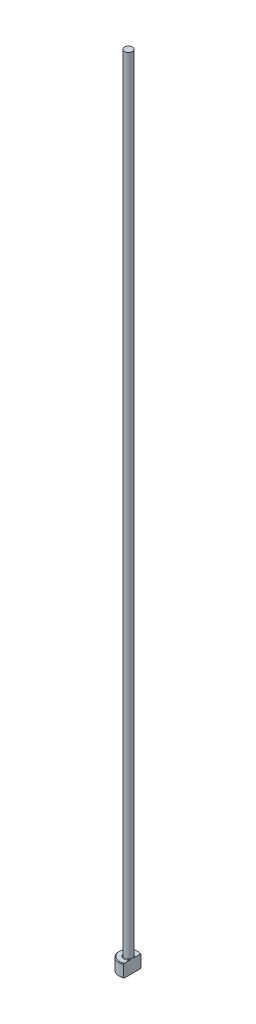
ISO-10303-21;
HEADER;
FILE_DESCRIPTION(('STEP AP214'),'2;1');
FILE_NAME('part.step','',(''),(''),'','','');
FILE_SCHEMA(('AUTOMOTIVE_DESIGN { 1 0 10303 214 1 1 1 1 }'));
ENDSEC;
DATA;
#1=APPLICATION_CONTEXT('core data for automotive mechanical design processes');
#2=APPLICATION_PROTOCOL_DEFINITION('international standard','automotive_design',2000,#1);
#3=PRODUCT_CONTEXT('',#1,'mechanical');
#4=PRODUCT('Part','Part','',(#3));
#5=PRODUCT_RELATED_PRODUCT_CATEGORY('part','',(#4));
#6=PRODUCT_DEFINITION_FORMATION('','',#4);
#7=PRODUCT_DEFINITION_CONTEXT('part definition',#1,'design');
#8=PRODUCT_DEFINITION('design','',#6,#7);
#9=PRODUCT_DEFINITION_SHAPE('','',#8);
#10=(LENGTH_UNIT() NAMED_UNIT(*) SI_UNIT(.MILLI.,.METRE.));
#11=(NAMED_UNIT(*) PLANE_ANGLE_UNIT() SI_UNIT($,.RADIAN.));
#12=(NAMED_UNIT(*) SI_UNIT($,.STERADIAN.) SOLID_ANGLE_UNIT());
#13=UNCERTAINTY_MEASURE_WITH_UNIT(LENGTH_MEASURE(1.E-05),#10,'distance_accuracy_value','');
#14=(GEOMETRIC_REPRESENTATION_CONTEXT(3) GLOBAL_UNCERTAINTY_ASSIGNED_CONTEXT((#13)) GLOBAL_UNIT_ASSIGNED_CONTEXT((#10,
#11,#12)) REPRESENTATION_CONTEXT('',''));
#15=CARTESIAN_POINT('',(0.,0.,0.));
#16=DIRECTION('',(0.,0.,1.));
#17=DIRECTION('',(1.,0.,0.));
#18=AXIS2_PLACEMENT_3D('',#15,#16,#17);
#19=CARTESIAN_POINT('',(0.,0.,0.));
#20=DIRECTION('',(0.,-1.,0.));
#21=DIRECTION('',(0.,0.,-1.));
#22=AXIS2_PLACEMENT_3D('',#19,#20,#21);
#23=PLANE('',#22);
#24=CARTESIAN_POINT('',(0.,0.,0.));
#25=DIRECTION('',(0.,-1.,0.));
#26=DIRECTION('',(0.,0.,-1.));
#27=AXIS2_PLACEMENT_3D('',#24,#25,#26);
#28=CIRCLE('',#27,2.8);
#29=CARTESIAN_POINT('',(1.24999999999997,0.,2.50549396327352));
#30=VERTEX_POINT('',#29);
#31=CARTESIAN_POINT('',(1.24999999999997,0.,-2.50549396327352));
#32=VERTEX_POINT('',#31);
#33=EDGE_CURVE('E98',#30,#32,#28,.T.);
#34=ORIENTED_EDGE('',*,*,#33,.T.);
#35=DIRECTION('',(0.,0.,1.));
#36=VECTOR('',#35,1.);
#37=CARTESIAN_POINT('',(1.24999999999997,0.,2.72717802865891));
#38=LINE('',#37,#36);
#39=EDGE_CURVE('E83',#32,#30,#38,.T.);
#40=ORIENTED_EDGE('',*,*,#39,.T.);
#41=EDGE_LOOP('',(#34,#40));
#42=FACE_BOUND('',#41,.T.);
#43=ADVANCED_FACE('F32',(#42),#23,.T.);
#44=CARTESIAN_POINT('',(0.,259.958771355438,0.));
#45=DIRECTION('',(0.,1.,0.));
#46=DIRECTION('',(0.,0.,1.));
#47=AXIS2_PLACEMENT_3D('',#44,#45,#46);
#48=CYLINDRICAL_SURFACE('',#47,2.99999999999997);
#49=CARTESIAN_POINT('',(0.,3.80000000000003,0.));
#50=DIRECTION('',(0.,1.,0.));
#51=DIRECTION('',(0.,0.,1.));
#52=AXIS2_PLACEMENT_3D('',#49,#50,#51);
#53=CIRCLE('',#52,2.99999999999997);
#54=CARTESIAN_POINT('',(1.24999999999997,3.80000000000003,2.72717802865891));
#55=VERTEX_POINT('',#54);
#56=CARTESIAN_POINT('',(1.24999999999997,3.80000000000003,-2.72717802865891));
#57=VERTEX_POINT('',#56);
#58=EDGE_CURVE('E104',#55,#57,#53,.F.);
#59=ORIENTED_EDGE('',*,*,#58,.T.);
#60=DIRECTION('',(0.,-1.,0.));
#61=VECTOR('',#60,1.);
#62=CARTESIAN_POINT('',(1.24999999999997,250.,-2.72717802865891));
#63=LINE('',#62,#61);
#64=CARTESIAN_POINT('',(1.24999999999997,0.199999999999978,-2.72717802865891));
#65=VERTEX_POINT('',#64);
#66=EDGE_CURVE('E183',#57,#65,#63,.T.);
#67=ORIENTED_EDGE('',*,*,#66,.T.);
#68=CARTESIAN_POINT('',(0.,0.199999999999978,0.));
#69=DIRECTION('',(0.,-1.,0.));
#70=DIRECTION('',(0.,0.,-1.));
#71=AXIS2_PLACEMENT_3D('',#68,#69,#70);
#72=CIRCLE('',#71,2.99999999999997);
#73=CARTESIAN_POINT('',(1.24999999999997,0.199999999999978,2.72717802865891));
#74=VERTEX_POINT('',#73);
#75=EDGE_CURVE('E100',#65,#74,#72,.F.);
#76=ORIENTED_EDGE('',*,*,#75,.T.);
#77=DIRECTION('',(0.,-1.,0.));
#78=VECTOR('',#77,1.);
#79=CARTESIAN_POINT('',(1.24999999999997,250.,2.72717802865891));
#80=LINE('',#79,#78);
#81=EDGE_CURVE('E93',#55,#74,#80,.T.);
#82=ORIENTED_EDGE('',*,*,#81,.F.);
#83=EDGE_LOOP('',(#59,#67,#76,#82));
#84=FACE_BOUND('',#83,.T.);
#85=ADVANCED_FACE('F158',(#84),#48,.T.);
#86=CARTESIAN_POINT('',(-2.99999999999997,4.,0.));
#87=DIRECTION('',(0.,1.,0.));
#88=DIRECTION('',(0.,0.,1.));
#89=AXIS2_PLACEMENT_3D('',#86,#87,#88);
#90=PLANE('',#89);
#91=CARTESIAN_POINT('',(0.,4.,0.));
#92=DIRECTION('',(0.,1.,0.));
#93=DIRECTION('',(0.,0.,1.));
#94=AXIS2_PLACEMENT_3D('',#91,#92,#93);
#95=CIRCLE('',#94,2.80000000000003);
#96=CARTESIAN_POINT('',(1.24999999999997,4.,-2.50549396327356));
#97=VERTEX_POINT('',#96);
#98=CARTESIAN_POINT('',(1.24999999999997,4.,2.50549396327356));
#99=VERTEX_POINT('',#98);
#100=EDGE_CURVE('E178',#97,#99,#95,.T.);
#101=ORIENTED_EDGE('',*,*,#100,.T.);
#102=DIRECTION('',(0.,0.,-1.));
#103=VECTOR('',#102,1.);
#104=CARTESIAN_POINT('',(1.24999999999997,4.,0.));
#105=LINE('',#104,#103);
#106=CARTESIAN_POINT('',(1.24999999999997,3.99999999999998,0.734846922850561));
#107=VERTEX_POINT('',#106);
#108=EDGE_CURVE('E57',#99,#107,#105,.T.);
#109=ORIENTED_EDGE('',*,*,#108,.T.);
#110=CARTESIAN_POINT('',(0.,4.,0.));
#111=DIRECTION('',(0.,1.,0.));
#112=DIRECTION('',(0.,0.,1.));
#113=AXIS2_PLACEMENT_3D('',#110,#111,#112);
#114=CIRCLE('',#113,1.44999999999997);
#115=CARTESIAN_POINT('',(1.24999999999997,3.99999999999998,-0.734846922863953));
#116=VERTEX_POINT('',#115);
#117=EDGE_CURVE('E107',#107,#116,#114,.F.);
#118=ORIENTED_EDGE('',*,*,#117,.T.);
#119=EDGE_CURVE('E136',#116,#97,#105,.T.);
#120=ORIENTED_EDGE('',*,*,#119,.T.);
#121=EDGE_LOOP('',(#101,#109,#118,#120));
#122=FACE_BOUND('',#121,.T.);
#123=ADVANCED_FACE('F147',(#122),#90,.T.);
#124=CARTESIAN_POINT('',(0.,4.,0.));
#125=DIRECTION('',(0.,-1.,0.));
#126=DIRECTION('',(0.,0.,-1.));
#127=AXIS2_PLACEMENT_3D('',#124,#125,#126);
#128=CONICAL_SURFACE('',#127,2.80000000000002,0.785398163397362);
#129=ORIENTED_EDGE('',*,*,#58,.F.);
#130=CARTESIAN_POINT('',(1.24999999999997,0.669029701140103,6.00219100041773));
#131=CARTESIAN_POINT('',(1.24999999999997,0.81160818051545,5.85654654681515));
#132=CARTESIAN_POINT('',(1.24999999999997,0.954083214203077,5.71080056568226));
#133=CARTESIAN_POINT('',(1.24999999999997,1.23900024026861,5.41878816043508));
#134=CARTESIAN_POINT('',(1.24999999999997,1.38144175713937,5.27252127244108));
#135=CARTESIAN_POINT('',(1.24999999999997,1.67009506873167,4.97540906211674));
#136=CARTESIAN_POINT('',(1.24999999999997,1.81629662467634,4.82455378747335));
#137=CARTESIAN_POINT('',(1.24999999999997,2.1079628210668,4.52263591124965));
#138=CARTESIAN_POINT('',(1.24999999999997,2.2534282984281,4.37157411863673));
#139=CARTESIAN_POINT('',(1.24999999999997,2.53664042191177,4.07620034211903));
#140=CARTESIAN_POINT('',(1.24999999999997,2.67441792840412,3.9319179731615));
#141=CARTESIAN_POINT('',(1.24999999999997,2.94919792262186,3.64255917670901));
#142=CARTESIAN_POINT('',(1.24999999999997,3.08620024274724,3.49748258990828));
#143=CARTESIAN_POINT('',(1.24999999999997,3.36003302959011,3.20523168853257));
#144=CARTESIAN_POINT('',(1.24999999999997,3.49685542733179,3.05804979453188));
#145=CARTESIAN_POINT('',(1.24999999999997,3.76866895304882,2.762223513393));
#146=CARTESIAN_POINT('',(1.24999999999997,3.90366148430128,2.61358041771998));
#147=CARTESIAN_POINT('',(1.24999999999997,4.16725075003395,2.3180330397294));
#148=CARTESIAN_POINT('',(1.24999999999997,4.2959210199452,2.17119494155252));
#149=CARTESIAN_POINT('',(1.24999999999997,4.48585031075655,1.94789558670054));
#150=CARTESIAN_POINT('',(1.24999999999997,4.54874737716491,1.87283059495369));
#151=CARTESIAN_POINT('',(1.24999999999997,4.67301560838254,1.72146479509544));
#152=CARTESIAN_POINT('',(1.24999999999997,4.73438704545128,1.64516421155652));
#153=CARTESIAN_POINT('',(1.24999999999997,4.85417557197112,1.49197305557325));
#154=CARTESIAN_POINT('',(1.24999999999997,4.91262187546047,1.41510543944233));
#155=CARTESIAN_POINT('',(1.24999999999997,5.02658525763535,1.259105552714));
#156=CARTESIAN_POINT('',(1.24999999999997,5.08209990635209,1.17997148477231));
#157=CARTESIAN_POINT('',(1.24999999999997,5.18831713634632,1.01914711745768));
#158=CARTESIAN_POINT('',(1.24999999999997,5.23904487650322,0.937473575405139));
#159=CARTESIAN_POINT('',(1.24999999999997,5.33341065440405,0.770163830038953));
#160=CARTESIAN_POINT('',(1.24999999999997,5.37706287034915,0.684536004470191));
#161=CARTESIAN_POINT('',(1.24999999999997,5.42311846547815,0.577571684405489));
#162=CARTESIAN_POINT('',(1.24999999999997,5.43098597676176,0.558575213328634));
#163=CARTESIAN_POINT('',(1.24999999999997,5.44613719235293,0.520340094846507));
#164=CARTESIAN_POINT('',(1.24999999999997,5.45342063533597,0.501101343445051));
#165=CARTESIAN_POINT('',(1.24999999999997,5.46734064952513,0.46239234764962));
#166=CARTESIAN_POINT('',(1.24999999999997,5.47397728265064,0.442922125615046));
#167=CARTESIAN_POINT('',(1.24999999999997,5.48654090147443,0.403756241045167));
#168=CARTESIAN_POINT('',(1.24999999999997,5.49246793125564,0.384060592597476));
#169=CARTESIAN_POINT('',(1.24999999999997,5.50889838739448,0.325328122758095));
#170=CARTESIAN_POINT('',(1.24999999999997,5.51829705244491,0.285972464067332));
#171=CARTESIAN_POINT('',(1.24999999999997,5.53364447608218,0.206573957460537));
#172=CARTESIAN_POINT('',(1.24999999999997,5.53959211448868,0.166530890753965));
#173=CARTESIAN_POINT('',(1.24999999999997,5.54775364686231,0.0853257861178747));
#174=CARTESIAN_POINT('',(1.24999999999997,5.54989812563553,0.0441566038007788));
#175=CARTESIAN_POINT('',(1.24999999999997,5.55009472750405,-0.038178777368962));
#176=CARTESIAN_POINT('',(1.24999999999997,5.54814807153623,-0.0793449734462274));
#177=CARTESIAN_POINT('',(1.24999999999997,5.540286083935,-0.161410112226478));
#178=CARTESIAN_POINT('',(1.24999999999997,5.53435930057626,-0.202307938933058));
#179=CARTESIAN_POINT('',(1.24999999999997,5.51889139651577,-0.283420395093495));
#180=CARTESIAN_POINT('',(1.24999999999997,5.50934853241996,-0.323634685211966));
#181=CARTESIAN_POINT('',(1.24999999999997,5.48253027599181,-0.41970113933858));
#182=CARTESIAN_POINT('',(1.24999999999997,5.4636894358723,-0.475114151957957));
#183=CARTESIAN_POINT('',(1.24999999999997,5.42119888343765,-0.584051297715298));
#184=CARTESIAN_POINT('',(1.24999999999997,5.39754618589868,-0.637574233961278));
#185=CARTESIAN_POINT('',(1.24999999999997,5.34650154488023,-0.743173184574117));
#186=CARTESIAN_POINT('',(1.24999999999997,5.31908834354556,-0.795238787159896));
#187=CARTESIAN_POINT('',(1.24999999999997,5.26156746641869,-0.897817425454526));
#188=CARTESIAN_POINT('',(1.24999999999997,5.23146075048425,-0.948331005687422));
#189=CARTESIAN_POINT('',(1.24999999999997,5.164212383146,-1.05610178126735));
#190=CARTESIAN_POINT('',(1.24999999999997,5.12671791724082,-1.11313743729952));
#191=CARTESIAN_POINT('',(1.24999999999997,5.04971534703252,-1.22583866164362));
#192=CARTESIAN_POINT('',(1.24999999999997,5.01020681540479,-1.28150393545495));
#193=CARTESIAN_POINT('',(1.24999999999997,4.88938978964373,-1.4469495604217));
#194=CARTESIAN_POINT('',(1.24999999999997,4.80584655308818,-1.55509257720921));
#195=CARTESIAN_POINT('',(1.24999999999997,4.63502000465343,-1.76881938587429));
#196=CARTESIAN_POINT('',(1.24999999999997,4.54772710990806,-1.87439538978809));
#197=CARTESIAN_POINT('',(1.24999999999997,4.37088701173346,-2.08355531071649));
#198=CARTESIAN_POINT('',(1.24999999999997,4.28134083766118,-2.18714010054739));
#199=CARTESIAN_POINT('',(1.24999999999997,4.10042772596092,-2.39324626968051));
#200=CARTESIAN_POINT('',(1.24999999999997,4.00905617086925,-2.49576357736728));
#201=CARTESIAN_POINT('',(1.24999999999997,3.82518962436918,-2.69980391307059));
#202=CARTESIAN_POINT('',(1.24999999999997,3.73269451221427,-2.80132683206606));
#203=CARTESIAN_POINT('',(1.24999999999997,3.45429710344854,-3.10446128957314));
#204=CARTESIAN_POINT('',(1.24999999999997,3.26719139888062,-3.30496607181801));
#205=CARTESIAN_POINT('',(1.24999999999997,2.87989899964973,-3.71613563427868));
#206=CARTESIAN_POINT('',(1.24999999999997,2.67959819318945,-3.92669240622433));
#207=CARTESIAN_POINT('',(1.24999999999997,2.27757992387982,-4.34666060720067));
#208=CARTESIAN_POINT('',(1.24999999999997,2.07586177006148,-4.55607137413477));
#209=CARTESIAN_POINT('',(1.24999999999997,1.67356669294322,-4.97197982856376));
#210=CARTESIAN_POINT('',(1.24999999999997,1.47299831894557,-5.17848579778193));
#211=CARTESIAN_POINT('',(1.24999999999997,1.07135927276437,-5.59078665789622));
#212=CARTESIAN_POINT('',(1.24999999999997,0.870288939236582,-5.79658187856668));
#213=CARTESIAN_POINT('',(1.24999999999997,0.669029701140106,-6.00219100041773));
#214=B_SPLINE_CURVE_WITH_KNOTS('',3,(#130,#131,#132,#133,#134,#135,#136,#137,#138,#139,#140,
#141,#142,#143,#144,#145,#146,#147,#148,#149,#150,#151,#152,#153,#154,#155,#156,#157,#158,#159,
#160,#161,#162,#163,#164,#165,#166,#167,#168,#169,#170,#171,#172,#173,#174,#175,#176,#177,#178,
#179,#180,#181,#182,#183,#184,#185,#186,#187,#188,#189,#190,#191,#192,#193,#194,#195,#196,#197,
#198,#199,#200,#201,#202,#203,#204,#205,#206,#207,#208,#209,#210,#211,#212,#213),.UNSPECIFIED.,
.F.,.F.,(4,2,2,2,2,2,2,2,2,2,2,2,2,2,2,2,2,2,2,2,2,2,2,2,2,2,2,2,2,2,2,2,2,2,2,2,2,2,2,2,2,4),
(0.,0.611447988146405,1.22394436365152,1.85417356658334,2.48331351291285,3.08180969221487,
3.68043067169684,4.28328558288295,4.88564854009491,5.47129854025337,5.7650827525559,
6.05881415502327,6.34846123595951,6.63834474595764,6.92660821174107,7.21428670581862,
7.27596254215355,7.33766582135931,7.39936318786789,7.46105671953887,7.58229876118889,
7.70358013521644,7.82705319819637,7.95048941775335,8.0742823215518,8.19813498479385,
8.37340718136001,8.54878844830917,8.72520546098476,8.90155985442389,9.10626834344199,
9.31102044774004,9.72083602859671,10.131769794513,10.5425191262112,10.9544882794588,
11.3665021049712,12.1892148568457,13.0610401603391,13.9333249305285,14.7969505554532,
15.6600991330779),.UNSPECIFIED.);
#215=EDGE_CURVE('E135',#55,#99,#214,.T.);
#216=ORIENTED_EDGE('',*,*,#215,.T.);
#217=ORIENTED_EDGE('',*,*,#100,.F.);
#218=EDGE_CURVE('E127',#97,#57,#214,.T.);
#219=ORIENTED_EDGE('',*,*,#218,.T.);
#220=EDGE_LOOP('',(#129,#216,#217,#219));
#221=FACE_BOUND('',#220,.T.);
#222=ADVANCED_FACE('F143',(#221),#128,.T.);
#223=CARTESIAN_POINT('',(0.,0.199999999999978,0.));
#224=DIRECTION('',(0.,1.,0.));
#225=DIRECTION('',(0.,0.,1.));
#226=AXIS2_PLACEMENT_3D('',#223,#224,#225);
#227=CONICAL_SURFACE('',#226,2.99999999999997,0.785398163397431);
#228=ORIENTED_EDGE('',*,*,#75,.F.);
#229=CARTESIAN_POINT('',(1.24999999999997,3.33097029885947,-6.00219100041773));
#230=CARTESIAN_POINT('',(1.24999999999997,3.18839181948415,-5.85654654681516));
#231=CARTESIAN_POINT('',(1.24999999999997,3.04591678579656,-5.71080056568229));
#232=CARTESIAN_POINT('',(1.24999999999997,2.76099975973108,-5.41878816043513));
#233=CARTESIAN_POINT('',(1.24999999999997,2.61855824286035,-5.27252127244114));
#234=CARTESIAN_POINT('',(1.24999999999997,2.32990493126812,-4.97540906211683));
#235=CARTESIAN_POINT('',(1.24999999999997,2.18370337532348,-4.82455378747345));
#236=CARTESIAN_POINT('',(1.24999999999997,1.89203717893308,-4.52263591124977));
#237=CARTESIAN_POINT('',(1.24999999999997,1.74657170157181,-4.37157411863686));
#238=CARTESIAN_POINT('',(1.24999999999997,1.46335957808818,-4.07620034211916));
#239=CARTESIAN_POINT('',(1.24999999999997,1.32558207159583,-3.93191797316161));
#240=CARTESIAN_POINT('',(1.24999999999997,1.0508020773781,-3.64255917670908));
#241=CARTESIAN_POINT('',(1.24999999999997,0.913799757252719,-3.49748258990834));
#242=CARTESIAN_POINT('',(1.24999999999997,0.639966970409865,-3.2052316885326));
#243=CARTESIAN_POINT('',(1.24999999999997,0.503144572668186,-3.0580497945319));
#244=CARTESIAN_POINT('',(1.24999999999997,0.231331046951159,-2.76222351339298));
#245=CARTESIAN_POINT('',(1.24999999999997,0.096338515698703,-2.61358041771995));
#246=CARTESIAN_POINT('',(1.24999999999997,-0.16725075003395,-2.31803303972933));
#247=CARTESIAN_POINT('',(1.24999999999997,-0.2959210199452,-2.17119494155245));
#248=CARTESIAN_POINT('',(1.24999999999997,-0.485850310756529,-1.94789558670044));
#249=CARTESIAN_POINT('',(1.24999999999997,-0.548747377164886,-1.87283059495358));
#250=CARTESIAN_POINT('',(1.24999999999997,-0.673015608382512,-1.72146479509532));
#251=CARTESIAN_POINT('',(1.24999999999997,-0.73438704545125,-1.64516421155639));
#252=CARTESIAN_POINT('',(1.24999999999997,-0.854175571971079,-1.49197305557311));
#253=CARTESIAN_POINT('',(1.24999999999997,-0.912621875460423,-1.41510543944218));
#254=CARTESIAN_POINT('',(1.24999999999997,-1.02658525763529,-1.25910555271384));
#255=CARTESIAN_POINT('',(1.24999999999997,-1.08209990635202,-1.17997148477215));
#256=CARTESIAN_POINT('',(1.24999999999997,-1.18831713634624,-1.0191471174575));
#257=CARTESIAN_POINT('',(1.24999999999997,-1.23904487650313,-0.937473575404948));
#258=CARTESIAN_POINT('',(1.24999999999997,-1.33341065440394,-0.770163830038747));
#259=CARTESIAN_POINT('',(1.24999999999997,-1.37706287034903,-0.684536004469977));
#260=CARTESIAN_POINT('',(1.24999999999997,-1.42311846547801,-0.577571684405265));
#261=CARTESIAN_POINT('',(1.24999999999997,-1.43098597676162,-0.558575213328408));
#262=CARTESIAN_POINT('',(1.24999999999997,-1.44613719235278,-0.520340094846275));
#263=CARTESIAN_POINT('',(1.24999999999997,-1.45342063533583,-0.501101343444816));
#264=CARTESIAN_POINT('',(1.24999999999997,-1.46734064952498,-0.46239234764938));
#265=CARTESIAN_POINT('',(1.24999999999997,-1.47397728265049,-0.442922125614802));
#266=CARTESIAN_POINT('',(1.24999999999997,-1.48654090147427,-0.403756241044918));
#267=CARTESIAN_POINT('',(1.24999999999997,-1.49246793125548,-0.384060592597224));
#268=CARTESIAN_POINT('',(1.24999999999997,-1.50889838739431,-0.325328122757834));
#269=CARTESIAN_POINT('',(1.24999999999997,-1.51829705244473,-0.285972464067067));
#270=CARTESIAN_POINT('',(1.24999999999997,-1.53364447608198,-0.206573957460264));
#271=CARTESIAN_POINT('',(1.24999999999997,-1.53959211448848,-0.166530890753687));
#272=CARTESIAN_POINT('',(1.24999999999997,-1.54775364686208,-0.0853257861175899));
#273=CARTESIAN_POINT('',(1.24999999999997,-1.54989812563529,-0.044156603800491));
#274=CARTESIAN_POINT('',(1.24999999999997,-1.55009472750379,0.0381787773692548));
#275=CARTESIAN_POINT('',(1.24999999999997,-1.54814807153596,0.0793449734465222));
#276=CARTESIAN_POINT('',(1.24999999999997,-1.54028608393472,0.161410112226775));
#277=CARTESIAN_POINT('',(1.24999999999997,-1.53435930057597,0.202307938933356));
#278=CARTESIAN_POINT('',(1.24999999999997,-1.51889139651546,0.283420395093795));
#279=CARTESIAN_POINT('',(1.24999999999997,-1.50934853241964,0.323634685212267));
#280=CARTESIAN_POINT('',(1.24999999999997,-1.48253027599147,0.419701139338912));
#281=CARTESIAN_POINT('',(1.24999999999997,-1.46368943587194,0.475114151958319));
#282=CARTESIAN_POINT('',(1.24999999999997,-1.42119888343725,0.584051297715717));
#283=CARTESIAN_POINT('',(1.24999999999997,-1.39754618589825,0.637574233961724));
#284=CARTESIAN_POINT('',(1.24999999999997,-1.34650154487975,0.743173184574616));
#285=CARTESIAN_POINT('',(1.24999999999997,-1.31908834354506,0.795238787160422));
#286=CARTESIAN_POINT('',(1.24999999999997,-1.26156746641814,0.897817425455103));
#287=CARTESIAN_POINT('',(1.24999999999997,-1.23146075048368,0.948331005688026));
#288=CARTESIAN_POINT('',(1.24999999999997,-1.16421238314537,1.05610178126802));
#289=CARTESIAN_POINT('',(1.24999999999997,-1.12671791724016,1.11313743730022));
#290=CARTESIAN_POINT('',(1.24999999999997,-1.0497153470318,1.22583866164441));
#291=CARTESIAN_POINT('',(1.24999999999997,-1.01020681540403,1.28150393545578));
#292=CARTESIAN_POINT('',(1.24999999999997,-0.889389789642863,1.44694956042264));
#293=CARTESIAN_POINT('',(1.24999999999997,-0.805846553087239,1.55509257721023));
#294=CARTESIAN_POINT('',(1.24999999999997,-0.635020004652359,1.76881938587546));
#295=CARTESIAN_POINT('',(1.24999999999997,-0.547727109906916,1.87439538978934));
#296=CARTESIAN_POINT('',(1.24999999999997,-0.370887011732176,2.08355531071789));
#297=CARTESIAN_POINT('',(1.24999999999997,-0.281340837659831,2.18714010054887));
#298=CARTESIAN_POINT('',(1.24999999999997,-0.100427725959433,2.39324626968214));
#299=CARTESIAN_POINT('',(1.24999999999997,-0.00905617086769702,2.49576357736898));
#300=CARTESIAN_POINT('',(1.24999999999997,0.174810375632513,2.69980391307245));
#301=CARTESIAN_POINT('',(1.24999999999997,0.267305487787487,2.80132683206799));
#302=CARTESIAN_POINT('',(1.24999999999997,0.545702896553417,3.1044612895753));
#303=CARTESIAN_POINT('',(1.24999999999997,0.73280860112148,3.30496607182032));
#304=CARTESIAN_POINT('',(1.24999999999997,1.12010100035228,3.71613563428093));
#305=CARTESIAN_POINT('',(1.24999999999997,1.32040180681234,3.92669240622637));
#306=CARTESIAN_POINT('',(1.24999999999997,1.72242007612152,4.34666060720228));
#307=CARTESIAN_POINT('',(1.24999999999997,1.92413822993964,4.55607137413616));
#308=CARTESIAN_POINT('',(1.24999999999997,2.32643330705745,4.97197982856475));
#309=CARTESIAN_POINT('',(1.24999999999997,2.52700168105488,5.17848579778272));
#310=CARTESIAN_POINT('',(1.24999999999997,2.92864072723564,5.59078665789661));
#311=CARTESIAN_POINT('',(1.24999999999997,3.12971106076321,5.79658187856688));
#312=CARTESIAN_POINT('',(1.24999999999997,3.33097029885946,6.00219100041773));
#313=B_SPLINE_CURVE_WITH_KNOTS('',3,(#229,#230,#231,#232,#233,#234,#235,#236,#237,#238,#239,
#240,#241,#242,#243,#244,#245,#246,#247,#248,#249,#250,#251,#252,#253,#254,#255,#256,#257,#258,
#259,#260,#261,#262,#263,#264,#265,#266,#267,#268,#269,#270,#271,#272,#273,#274,#275,#276,#277,
#278,#279,#280,#281,#282,#283,#284,#285,#286,#287,#288,#289,#290,#291,#292,#293,#294,#295,#296,
#297,#298,#299,#300,#301,#302,#303,#304,#305,#306,#307,#308,#309,#310,#311,#312),.UNSPECIFIED.,
.F.,.F.,(4,2,2,2,2,2,2,2,2,2,2,2,2,2,2,2,2,2,2,2,2,2,2,2,2,2,2,2,2,2,2,2,2,2,2,2,2,2,2,2,2,4),
(0.,0.611447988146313,1.22394436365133,1.85417356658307,2.48331351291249,3.08180969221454,
3.68043067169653,4.28328558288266,4.88564854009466,5.47129854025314,5.76508275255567,
6.05881415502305,6.3484612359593,6.63834474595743,6.92660821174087,7.21428670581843,
7.27596254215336,7.33766582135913,7.39936318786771,7.46105671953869,7.58229876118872,
7.70358013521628,7.82705319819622,7.95048941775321,8.07428232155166,8.19813498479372,
8.37340718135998,8.54878844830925,8.72520546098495,8.90155985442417,9.10626834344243,
9.31102044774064,9.72083602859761,10.1317697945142,10.5425191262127,10.9544882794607,
11.3665021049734,12.1892148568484,13.0610401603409,13.9333249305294,14.7969505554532,
15.660099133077),.UNSPECIFIED.);
#314=EDGE_CURVE('E86',#65,#32,#313,.T.);
#315=ORIENTED_EDGE('',*,*,#314,.T.);
#316=ORIENTED_EDGE('',*,*,#33,.F.);
#317=EDGE_CURVE('E89',#30,#74,#313,.T.);
#318=ORIENTED_EDGE('',*,*,#317,.T.);
#319=EDGE_LOOP('',(#228,#315,#316,#318));
#320=FACE_BOUND('',#319,.T.);
#321=ADVANCED_FACE('F97',(#320),#227,.T.);
#322=CARTESIAN_POINT('',(0.,4.19999999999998,0.));
#323=DIRECTION('',(0.,1.,0.));
#324=DIRECTION('',(0.,0.,1.));
#325=AXIS2_PLACEMENT_3D('',#322,#323,#324);
#326=TOROIDAL_SURFACE('',#325,1.44999999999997,0.2);
#327=CARTESIAN_POINT('',(1.24999999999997,4.19999999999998,0.));
#328=CARTESIAN_POINT('',(1.24999999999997,4.20000051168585,-1.97679442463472E-10));
#329=CARTESIAN_POINT('',(1.24999999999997,4.2000010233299,-1.08908064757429E-07));
#330=CARTESIAN_POINT('',(1.24999999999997,4.2000020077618,-4.52594763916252E-07));
#331=CARTESIAN_POINT('',(1.24999999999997,4.20000247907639,-6.9099304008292E-07));
#332=CARTESIAN_POINT('',(1.24999999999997,4.20000341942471,-1.26357943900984E-06));
#333=CARTESIAN_POINT('',(1.24999999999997,4.20000388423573,-1.60457618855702E-06));
#334=CARTESIAN_POINT('',(1.24999999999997,4.20000476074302,-2.3395490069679E-06));
#335=CARTESIAN_POINT('',(1.24999999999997,4.20000517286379,-2.73304148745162E-06));
#336=CARTESIAN_POINT('',(1.24999999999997,4.20000655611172,-4.1454401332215E-06));
#337=CARTESIAN_POINT('',(1.24999999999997,4.20000745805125,-5.23310092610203E-06));
#338=CARTESIAN_POINT('',(1.24999999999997,4.20000906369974,-7.47950361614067E-06));
#339=CARTESIAN_POINT('',(1.24999999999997,4.20000977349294,-8.63414438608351E-06));
#340=CARTESIAN_POINT('',(1.24999999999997,4.20001244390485,-1.31453477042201E-05));
#341=CARTESIAN_POINT('',(1.24999999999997,4.20001426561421,-1.65880555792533E-05));
#342=CARTESIAN_POINT('',(1.24999999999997,4.20001724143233,-2.33729029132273E-05));
#343=CARTESIAN_POINT('',(1.24999999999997,4.20001844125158,-2.66956154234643E-05));
#344=CARTESIAN_POINT('',(1.24999999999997,4.20002354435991,-4.08635086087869E-05));
#345=CARTESIAN_POINT('',(1.24999999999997,4.2000274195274,-5.17114614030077E-05));
#346=CARTESIAN_POINT('',(1.24999999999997,4.2000336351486,-7.2005767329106E-05));
#347=CARTESIAN_POINT('',(1.24999999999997,4.2000361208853,-8.14057065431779E-05));
#348=CARTESIAN_POINT('',(1.24999999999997,4.20005581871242,-0.00014978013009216));
#349=CARTESIAN_POINT('',(1.24999999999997,4.20008094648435,-0.000206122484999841));
#350=CARTESIAN_POINT('',(1.24999999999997,4.20017507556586,-0.000425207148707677));
#351=CARTESIAN_POINT('',(1.24999999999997,4.20023819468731,-0.000589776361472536));
#352=CARTESIAN_POINT('',(1.24999999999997,4.20048692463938,-0.00122878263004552));
#353=CARTESIAN_POINT('',(1.24999999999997,4.20067870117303,-0.00170134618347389));
#354=CARTESIAN_POINT('',(1.24999999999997,4.20146022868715,-0.00363636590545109));
#355=CARTESIAN_POINT('',(1.24999999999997,4.20204298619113,-0.0051009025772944));
#356=CARTESIAN_POINT('',(1.24999999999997,4.20939719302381,-0.0235712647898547));
#357=CARTESIAN_POINT('',(1.24999999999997,4.21621259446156,-0.0405643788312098));
#358=CARTESIAN_POINT('',(1.24999999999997,4.22951000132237,-0.0739606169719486));
#359=CARTESIAN_POINT('',(1.24999999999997,4.23599508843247,-0.0903626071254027));
#360=CARTESIAN_POINT('',(1.24999999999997,4.24961430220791,-0.12511129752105));
#361=CARTESIAN_POINT('',(1.24999999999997,4.25673641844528,-0.143462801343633));
#362=CARTESIAN_POINT('',(1.24999999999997,4.27085039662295,-0.180427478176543));
#363=CARTESIAN_POINT('',(1.24999999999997,4.27784022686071,-0.199041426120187));
#364=CARTESIAN_POINT('',(1.24999999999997,4.29479134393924,-0.245221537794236));
#365=CARTESIAN_POINT('',(1.24999999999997,4.30459026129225,-0.272848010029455));
#366=CARTESIAN_POINT('',(1.24999999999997,4.32310234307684,-0.327738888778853));
#367=CARTESIAN_POINT('',(1.24999999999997,4.3318356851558,-0.354996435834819));
#368=CARTESIAN_POINT('',(1.24999999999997,4.34936561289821,-0.413744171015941));
#369=CARTESIAN_POINT('',(1.24999999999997,4.35799470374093,-0.445285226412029));
#370=CARTESIAN_POINT('',(1.24999999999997,4.37338463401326,-0.50909191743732));
#371=CARTESIAN_POINT('',(1.24999999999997,4.38013036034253,-0.541361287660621));
#372=CARTESIAN_POINT('',(1.24999999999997,4.39136059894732,-0.608339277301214));
#373=CARTESIAN_POINT('',(1.24999999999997,4.39568167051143,-0.643076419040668));
#374=CARTESIAN_POINT('',(1.24999999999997,4.40037605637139,-0.712733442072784));
#375=CARTESIAN_POINT('',(1.24999999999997,4.40076553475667,-0.747651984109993));
#376=CARTESIAN_POINT('',(1.24999999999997,4.39677668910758,-0.808103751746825));
#377=CARTESIAN_POINT('',(1.24999999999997,4.39361441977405,-0.833711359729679));
#378=CARTESIAN_POINT('',(1.24999999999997,4.38355990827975,-0.883915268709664));
#379=CARTESIAN_POINT('',(1.24999999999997,4.37671813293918,-0.908520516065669));
#380=CARTESIAN_POINT('',(1.24999999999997,4.36252570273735,-0.944879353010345));
#381=CARTESIAN_POINT('',(1.24999999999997,4.35688428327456,-0.957298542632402));
#382=CARTESIAN_POINT('',(1.24999999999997,4.34399066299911,-0.981318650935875));
#383=CARTESIAN_POINT('',(1.24999999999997,4.33673636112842,-0.992918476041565));
#384=CARTESIAN_POINT('',(1.24999999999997,4.32199744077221,-1.01267533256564));
#385=CARTESIAN_POINT('',(1.24999999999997,4.31482723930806,-1.02106482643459));
#386=CARTESIAN_POINT('',(1.24999999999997,4.29924321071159,-1.03659690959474));
#387=CARTESIAN_POINT('',(1.24999999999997,4.29083198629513,-1.04374204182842));
#388=CARTESIAN_POINT('',(1.24999999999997,4.27498600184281,-1.05478694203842));
#389=CARTESIAN_POINT('',(1.24999999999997,4.26780814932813,-1.059053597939));
#390=CARTESIAN_POINT('',(1.24999999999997,4.25284782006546,-1.06635953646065));
#391=CARTESIAN_POINT('',(1.24999999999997,4.24506572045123,-1.06939957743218));
#392=CARTESIAN_POINT('',(1.24999999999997,4.22901828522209,-1.07404931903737));
#393=CARTESIAN_POINT('',(1.24999999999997,4.22074990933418,-1.07564870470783));
#394=CARTESIAN_POINT('',(1.24999999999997,4.20405985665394,-1.07723717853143));
#395=CARTESIAN_POINT('',(1.24999999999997,4.19563825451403,-1.07722703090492));
#396=CARTESIAN_POINT('',(1.24999999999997,4.17988128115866,-1.07569157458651));
#397=CARTESIAN_POINT('',(1.24999999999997,4.17252879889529,-1.0743339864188));
#398=CARTESIAN_POINT('',(1.24999999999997,4.15814333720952,-1.07044616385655));
#399=CARTESIAN_POINT('',(1.24999999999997,4.15111040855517,-1.06791574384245));
#400=CARTESIAN_POINT('',(1.24999999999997,4.13724955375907,-1.06171920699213));
#401=CARTESIAN_POINT('',(1.24999999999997,4.13043935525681,-1.05801386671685));
#402=CARTESIAN_POINT('',(1.24999999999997,4.11740316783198,-1.04969609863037));
#403=CARTESIAN_POINT('',(1.24999999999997,4.11117742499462,-1.04508329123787));
#404=CARTESIAN_POINT('',(1.24999999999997,4.09586196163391,-1.03220341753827));
#405=CARTESIAN_POINT('',(1.24999999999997,4.08723799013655,-1.02338140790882));
#406=CARTESIAN_POINT('',(1.24999999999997,4.07148817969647,-1.00448021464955));
#407=CARTESIAN_POINT('',(1.24999999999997,4.0643671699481,-0.994397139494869));
#408=CARTESIAN_POINT('',(1.24999999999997,4.04800089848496,-0.967694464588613));
#409=CARTESIAN_POINT('',(1.24999999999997,4.0397014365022,-0.950498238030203));
#410=CARTESIAN_POINT('',(1.24999999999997,4.02582422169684,-0.915117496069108));
#411=CARTESIAN_POINT('',(1.24999999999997,4.02024415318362,-0.896933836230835));
#412=CARTESIAN_POINT('',(1.24999999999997,4.00805724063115,-0.84678106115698));
#413=CARTESIAN_POINT('',(1.24999999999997,4.00359525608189,-0.814297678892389));
#414=CARTESIAN_POINT('',(1.24999999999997,3.99933348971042,-0.748574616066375));
#415=CARTESIAN_POINT('',(1.24999999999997,3.99961552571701,-0.715331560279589));
#416=CARTESIAN_POINT('',(1.24999999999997,4.00446632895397,-0.637920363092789));
#417=CARTESIAN_POINT('',(1.24999999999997,4.0104488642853,-0.593849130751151));
#418=CARTESIAN_POINT('',(1.24999999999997,4.02681929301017,-0.506401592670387));
#419=CARTESIAN_POINT('',(1.24999999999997,4.03722697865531,-0.463029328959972));
#420=CARTESIAN_POINT('',(1.24999999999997,4.06007158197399,-0.380638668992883));
#421=CARTESIAN_POINT('',(1.24999999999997,4.07227412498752,-0.341553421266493));
#422=CARTESIAN_POINT('',(1.24999999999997,4.09824323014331,-0.264347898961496));
#423=CARTESIAN_POINT('',(1.24999999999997,4.11199311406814,-0.226221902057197));
#424=CARTESIAN_POINT('',(1.24999999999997,4.13108825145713,-0.175350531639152));
#425=CARTESIAN_POINT('',(1.24999999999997,4.13599999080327,-0.162438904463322));
#426=CARTESIAN_POINT('',(1.24999999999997,4.14604281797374,-0.136318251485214));
#427=CARTESIAN_POINT('',(1.24999999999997,4.15117629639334,-0.123110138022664));
#428=CARTESIAN_POINT('',(1.24999999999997,4.163417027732,-0.0918425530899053));
#429=CARTESIAN_POINT('',(1.24999999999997,4.1705525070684,-0.0737943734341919));
#430=CARTESIAN_POINT('',(1.24999999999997,4.18426943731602,-0.0393586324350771));
#431=CARTESIAN_POINT('',(1.24999999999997,4.19084281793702,-0.0229681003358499));
#432=CARTESIAN_POINT('',(1.24999999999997,4.19795564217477,-0.00510438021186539));
#433=CARTESIAN_POINT('',(1.24999999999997,4.19853702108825,-0.00364331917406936));
#434=CARTESIAN_POINT('',(1.24999999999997,4.19931818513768,-0.0017091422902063));
#435=CARTESIAN_POINT('',(1.24999999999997,4.1995110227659,-0.00123396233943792));
#436=CARTESIAN_POINT('',(1.24999999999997,4.1997610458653,-0.000591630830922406));
#437=CARTESIAN_POINT('',(1.24999999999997,4.19982443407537,-0.000426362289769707));
#438=CARTESIAN_POINT('',(1.24999999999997,4.19991892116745,-0.0002064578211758));
#439=CARTESIAN_POINT('',(1.24999999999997,4.19994410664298,-0.000149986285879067));
#440=CARTESIAN_POINT('',(1.24999999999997,4.19996383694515,-8.14647488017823E-05));
#441=CARTESIAN_POINT('',(1.24999999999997,4.19996632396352,-7.2055156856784E-05));
#442=CARTESIAN_POINT('',(1.24999999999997,4.19997254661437,-5.17396177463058E-05));
#443=CARTESIAN_POINT('',(1.24999999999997,4.19997642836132,-4.08803464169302E-05));
#444=CARTESIAN_POINT('',(1.24999999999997,4.19998153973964,-2.66997573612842E-05));
#445=CARTESIAN_POINT('',(1.24999999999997,4.19998274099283,-2.33755458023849E-05));
#446=CARTESIAN_POINT('',(1.24999999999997,4.1999857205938,-1.65878758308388E-05));
#447=CARTESIAN_POINT('',(1.24999999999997,4.19998754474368,-1.3143899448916E-05));
#448=CARTESIAN_POINT('',(1.24999999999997,4.19999021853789,-8.63150514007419E-06));
#449=CARTESIAN_POINT('',(1.24999999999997,4.19999092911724,-7.47674883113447E-06));
#450=CARTESIAN_POINT('',(1.24999999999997,4.19999253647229,-5.23027083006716E-06));
#451=CARTESIAN_POINT('',(1.24999999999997,4.19999343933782,-4.14265823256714E-06));
#452=CARTESIAN_POINT('',(1.24999999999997,4.19999482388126,-2.73051192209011E-06));
#453=CARTESIAN_POINT('',(1.24999999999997,4.19999523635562,-2.33712919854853E-06));
#454=CARTESIAN_POINT('',(1.24999999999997,4.19999611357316,-1.60243918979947E-06));
#455=CARTESIAN_POINT('',(1.24999999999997,4.19999657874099,-1.26161621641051E-06));
#456=CARTESIAN_POINT('',(1.24999999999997,4.19999751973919,-6.89449599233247E-07));
#457=CARTESIAN_POINT('',(1.24999999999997,4.19999799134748,-4.51288703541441E-07));
#458=CARTESIAN_POINT('',(1.24999999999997,4.19999897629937,-1.08178111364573E-07));
#459=CARTESIAN_POINT('',(1.24999999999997,4.1999994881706,1.97734883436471E-10));
#460=CARTESIAN_POINT('',(1.24999999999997,4.19999999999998,0.));
#461=B_SPLINE_CURVE_WITH_KNOTS('',3,(#327,#328,#329,#330,#331,#332,#333,#334,#335,#336,#337,
#338,#339,#340,#341,#342,#343,#344,#345,#346,#347,#348,#349,#350,#351,#352,#353,#354,#355,#356,
#357,#358,#359,#360,#361,#362,#363,#364,#365,#366,#367,#368,#369,#370,#371,#372,#373,#374,#375,
#376,#377,#378,#379,#380,#381,#382,#383,#384,#385,#386,#387,#388,#389,#390,#391,#392,#393,#394,
#395,#396,#397,#398,#399,#400,#401,#402,#403,#404,#405,#406,#407,#408,#409,#410,#411,#412,#413,
#414,#415,#416,#417,#418,#419,#420,#421,#422,#423,#424,#425,#426,#427,#428,#429,#430,#431,#432,
#433,#434,#435,#436,#437,#438,#439,#440,#441,#442,#443,#444,#445,#446,#447,#448,#449,#450,#451,
#452,#453,#454,#455,#456,#457,#458,#459,#460),.UNSPECIFIED.,.T.,.F.,(4,2,2,2,2,2,2,2,2,2,2,2,2,
2,2,2,2,2,2,2,2,2,2,2,2,2,2,2,2,2,2,2,2,2,2,2,2,2,2,2,2,2,2,2,2,2,2,2,2,2,2,2,2,2,2,2,2,2,2,2,2,
2,2,2,2,2,4),(0.,1.53427573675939E-06,3.11115055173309E-06,4.83351634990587E-06,
6.54098944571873E-06,1.07594293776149E-05,1.48222851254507E-05,2.64707313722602E-05,
3.70576288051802E-05,7.16088726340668E-05,0.000100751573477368,0.000285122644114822,
0.000814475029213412,0.00234373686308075,0.00707317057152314,0.0619940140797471,
0.114907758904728,0.173961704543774,0.233609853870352,0.321537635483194,0.407388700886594,
0.505443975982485,0.604264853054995,0.709126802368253,0.813557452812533,0.890773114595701,
0.96695575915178,1.0077884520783,1.04867465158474,1.08167318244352,1.11460346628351,
1.13955805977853,1.16449720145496,1.18961351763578,1.21471790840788,1.23704542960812,
1.25937648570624,1.28254952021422,1.30573226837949,1.34253218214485,1.3794485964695,
1.43640829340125,1.49331940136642,1.591136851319,1.69064301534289,1.82371118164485,
1.95738088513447,2.08016146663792,2.20172662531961,2.24316968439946,2.28568093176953,
2.34390494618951,2.39687801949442,2.4015962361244,2.40313396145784,2.40366556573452,
2.40385035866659,2.40387953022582,2.40391411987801,2.40392471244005,2.40393636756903,
2.40394043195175,2.4039446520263,2.40394636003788,2.40394808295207,2.40394966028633,
2.40395119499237),.UNSPECIFIED.);
#462=CARTESIAN_POINT('',(1.24999999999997,4.19999999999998,0.));
#463=VERTEX_POINT('',#462);
#464=EDGE_CURVE('E11',#116,#463,#461,.T.);
#465=ORIENTED_EDGE('',*,*,#464,.F.);
#466=ORIENTED_EDGE('',*,*,#117,.F.);
#467=CARTESIAN_POINT('',(1.24999999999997,4.19999999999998,0.));
#468=CARTESIAN_POINT('',(1.24999999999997,4.19999948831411,1.97679415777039E-10));
#469=CARTESIAN_POINT('',(1.24999999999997,4.19999897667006,1.08908064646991E-07));
#470=CARTESIAN_POINT('',(1.24999999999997,4.19999799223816,4.52594763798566E-07));
#471=CARTESIAN_POINT('',(1.24999999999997,4.19999752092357,6.90993040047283E-07));
#472=CARTESIAN_POINT('',(1.24999999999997,4.19999658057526,1.26357943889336E-06));
#473=CARTESIAN_POINT('',(1.24999999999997,4.19999611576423,1.60457618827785E-06));
#474=CARTESIAN_POINT('',(1.24999999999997,4.19999523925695,2.33954900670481E-06));
#475=CARTESIAN_POINT('',(1.24999999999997,4.19999482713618,2.73304148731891E-06));
#476=CARTESIAN_POINT('',(1.24999999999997,4.19999344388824,4.14544013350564E-06));
#477=CARTESIAN_POINT('',(1.24999999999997,4.19999254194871,5.23310092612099E-06));
#478=CARTESIAN_POINT('',(1.24999999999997,4.19999093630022,7.47950361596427E-06));
#479=CARTESIAN_POINT('',(1.24999999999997,4.19999022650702,8.6341443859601E-06));
#480=CARTESIAN_POINT('',(1.24999999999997,4.19998755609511,1.31453477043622E-05));
#481=CARTESIAN_POINT('',(1.24999999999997,4.19998573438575,1.65880555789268E-05));
#482=CARTESIAN_POINT('',(1.24999999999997,4.19998275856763,2.33729029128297E-05));
#483=CARTESIAN_POINT('',(1.24999999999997,4.19998155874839,2.66956154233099E-05));
#484=CARTESIAN_POINT('',(1.24999999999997,4.19997645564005,4.08635086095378E-05));
#485=CARTESIAN_POINT('',(1.24999999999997,4.19997258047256,5.17114614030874E-05));
#486=CARTESIAN_POINT('',(1.24999999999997,4.19996636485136,7.200576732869E-05));
#487=CARTESIAN_POINT('',(1.24999999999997,4.19996387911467,8.14057065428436E-05));
#488=CARTESIAN_POINT('',(1.24999999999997,4.19994418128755,0.000149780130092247));
#489=CARTESIAN_POINT('',(1.24999999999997,4.19991905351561,0.000206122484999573));
#490=CARTESIAN_POINT('',(1.24999999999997,4.1998249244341,0.000425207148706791));
#491=CARTESIAN_POINT('',(1.24999999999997,4.19976180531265,0.000589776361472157));
#492=CARTESIAN_POINT('',(1.24999999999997,4.19951307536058,0.00122878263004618));
#493=CARTESIAN_POINT('',(1.24999999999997,4.19932129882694,0.00170134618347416));
#494=CARTESIAN_POINT('',(1.24999999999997,4.19853977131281,0.00363636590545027));
#495=CARTESIAN_POINT('',(1.24999999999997,4.19795701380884,0.00510090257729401));
#496=CARTESIAN_POINT('',(1.24999999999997,4.19060280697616,0.0235712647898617));
#497=CARTESIAN_POINT('',(1.24999999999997,4.18378740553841,0.0405643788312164));
#498=CARTESIAN_POINT('',(1.24999999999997,4.17048999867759,0.0739606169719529));
#499=CARTESIAN_POINT('',(1.24999999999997,4.16400491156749,0.090362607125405));
#500=CARTESIAN_POINT('',(1.24999999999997,4.15038569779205,0.125111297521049));
#501=CARTESIAN_POINT('',(1.24999999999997,4.14326358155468,0.143462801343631));
#502=CARTESIAN_POINT('',(1.24999999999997,4.12914960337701,0.180427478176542));
#503=CARTESIAN_POINT('',(1.24999999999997,4.12215977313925,0.199041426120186));
#504=CARTESIAN_POINT('',(1.24999999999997,4.10520865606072,0.245221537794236));
#505=CARTESIAN_POINT('',(1.24999999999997,4.09540973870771,0.272848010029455));
#506=CARTESIAN_POINT('',(1.24999999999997,4.07689765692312,0.327738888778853));
#507=CARTESIAN_POINT('',(1.24999999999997,4.06816431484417,0.354996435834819));
#508=CARTESIAN_POINT('',(1.24999999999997,4.05063438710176,0.413744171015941));
#509=CARTESIAN_POINT('',(1.24999999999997,4.04200529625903,0.445285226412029));
#510=CARTESIAN_POINT('',(1.24999999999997,4.0266153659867,0.50909191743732));
#511=CARTESIAN_POINT('',(1.24999999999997,4.01986963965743,0.541361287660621));
#512=CARTESIAN_POINT('',(1.24999999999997,4.00863940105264,0.608339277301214));
#513=CARTESIAN_POINT('',(1.24999999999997,4.00431832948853,0.643076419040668));
#514=CARTESIAN_POINT('',(1.24999999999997,3.99962394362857,0.712733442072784));
#515=CARTESIAN_POINT('',(1.24999999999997,3.99923446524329,0.747651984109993));
#516=CARTESIAN_POINT('',(1.24999999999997,4.00322331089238,0.808103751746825));
#517=CARTESIAN_POINT('',(1.24999999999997,4.00638558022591,0.833711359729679));
#518=CARTESIAN_POINT('',(1.24999999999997,4.01644009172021,0.883915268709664));
#519=CARTESIAN_POINT('',(1.24999999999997,4.02328186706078,0.908520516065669));
#520=CARTESIAN_POINT('',(1.24999999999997,4.03747429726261,0.944879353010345));
#521=CARTESIAN_POINT('',(1.24999999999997,4.0431157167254,0.957298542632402));
#522=CARTESIAN_POINT('',(1.24999999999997,4.05600933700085,0.981318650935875));
#523=CARTESIAN_POINT('',(1.24999999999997,4.06326363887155,0.992918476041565));
#524=CARTESIAN_POINT('',(1.24999999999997,4.07800255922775,1.01267533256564));
#525=CARTESIAN_POINT('',(1.24999999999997,4.08517276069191,1.02106482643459));
#526=CARTESIAN_POINT('',(1.24999999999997,4.10075678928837,1.03659690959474));
#527=CARTESIAN_POINT('',(1.24999999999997,4.10916801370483,1.04374204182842));
#528=CARTESIAN_POINT('',(1.24999999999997,4.12501399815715,1.05478694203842));
#529=CARTESIAN_POINT('',(1.24999999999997,4.13219185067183,1.059053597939));
#530=CARTESIAN_POINT('',(1.24999999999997,4.1471521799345,1.06635953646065));
#531=CARTESIAN_POINT('',(1.24999999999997,4.15493427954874,1.06939957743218));
#532=CARTESIAN_POINT('',(1.24999999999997,4.17098171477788,1.07404931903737));
#533=CARTESIAN_POINT('',(1.24999999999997,4.17925009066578,1.07564870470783));
#534=CARTESIAN_POINT('',(1.24999999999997,4.19594014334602,1.07723717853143));
#535=CARTESIAN_POINT('',(1.24999999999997,4.20436174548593,1.07722703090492));
#536=CARTESIAN_POINT('',(1.24999999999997,4.2201187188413,1.07569157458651));
#537=CARTESIAN_POINT('',(1.24999999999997,4.22747120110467,1.0743339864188));
#538=CARTESIAN_POINT('',(1.24999999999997,4.24185666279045,1.07044616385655));
#539=CARTESIAN_POINT('',(1.24999999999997,4.24888959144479,1.06791574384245));
#540=CARTESIAN_POINT('',(1.24999999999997,4.26275044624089,1.06171920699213));
#541=CARTESIAN_POINT('',(1.24999999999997,4.26956064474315,1.05801386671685));
#542=CARTESIAN_POINT('',(1.24999999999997,4.28259683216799,1.04969609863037));
#543=CARTESIAN_POINT('',(1.24999999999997,4.28882257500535,1.04508329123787));
#544=CARTESIAN_POINT('',(1.24999999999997,4.30413803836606,1.03220341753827));
#545=CARTESIAN_POINT('',(1.24999999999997,4.31276200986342,1.02338140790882));
#546=CARTESIAN_POINT('',(1.24999999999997,4.32851182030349,1.00448021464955));
#547=CARTESIAN_POINT('',(1.24999999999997,4.33563283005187,0.994397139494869));
#548=CARTESIAN_POINT('',(1.24999999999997,4.351999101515,0.967694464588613));
#549=CARTESIAN_POINT('',(1.24999999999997,4.36029856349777,0.950498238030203));
#550=CARTESIAN_POINT('',(1.24999999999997,4.37417577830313,0.915117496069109));
#551=CARTESIAN_POINT('',(1.24999999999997,4.37975584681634,0.896933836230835));
#552=CARTESIAN_POINT('',(1.24999999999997,4.39194275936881,0.84678106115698));
#553=CARTESIAN_POINT('',(1.24999999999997,4.39640474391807,0.814297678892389));
#554=CARTESIAN_POINT('',(1.24999999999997,4.40066651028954,0.748574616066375));
#555=CARTESIAN_POINT('',(1.24999999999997,4.40038447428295,0.715331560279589));
#556=CARTESIAN_POINT('',(1.24999999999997,4.395533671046,0.637920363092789));
#557=CARTESIAN_POINT('',(1.24999999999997,4.38955113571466,0.593849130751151));
#558=CARTESIAN_POINT('',(1.24999999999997,4.3731807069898,0.506401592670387));
#559=CARTESIAN_POINT('',(1.24999999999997,4.36277302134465,0.463029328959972));
#560=CARTESIAN_POINT('',(1.24999999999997,4.33992841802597,0.380638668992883));
#561=CARTESIAN_POINT('',(1.24999999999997,4.32772587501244,0.341553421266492));
#562=CARTESIAN_POINT('',(1.24999999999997,4.30175676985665,0.264347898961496));
#563=CARTESIAN_POINT('',(1.24999999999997,4.28800688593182,0.226221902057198));
#564=CARTESIAN_POINT('',(1.24999999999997,4.26891174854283,0.175350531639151));
#565=CARTESIAN_POINT('',(1.24999999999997,4.26400000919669,0.162438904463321));
#566=CARTESIAN_POINT('',(1.24999999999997,4.25395718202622,0.136318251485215));
#567=CARTESIAN_POINT('',(1.24999999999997,4.24882370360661,0.123110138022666));
#568=CARTESIAN_POINT('',(1.24999999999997,4.23658297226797,0.0918425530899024));
#569=CARTESIAN_POINT('',(1.24999999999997,4.22944749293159,0.0737943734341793));
#570=CARTESIAN_POINT('',(1.24999999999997,4.21573056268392,0.0393586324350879));
#571=CARTESIAN_POINT('',(1.24999999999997,4.20915718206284,0.0229681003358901));
#572=CARTESIAN_POINT('',(1.24999999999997,4.2020443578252,0.0051043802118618));
#573=CARTESIAN_POINT('',(1.24999999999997,4.20146297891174,0.00364331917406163));
#574=CARTESIAN_POINT('',(1.24999999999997,4.20068181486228,0.00170914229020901));
#575=CARTESIAN_POINT('',(1.24999999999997,4.20048897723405,0.0012339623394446));
#576=CARTESIAN_POINT('',(1.24999999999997,4.20023895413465,0.000591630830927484));
#577=CARTESIAN_POINT('',(1.24999999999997,4.20017556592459,0.000426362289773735));
#578=CARTESIAN_POINT('',(1.24999999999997,4.20008107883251,0.000206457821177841));
#579=CARTESIAN_POINT('',(1.24999999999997,4.20005589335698,0.000149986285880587));
#580=CARTESIAN_POINT('',(1.24999999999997,4.20003616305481,8.14647488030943E-05));
#581=CARTESIAN_POINT('',(1.24999999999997,4.20003367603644,7.20551568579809E-05));
#582=CARTESIAN_POINT('',(1.24999999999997,4.2000274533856,5.17396177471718E-05));
#583=CARTESIAN_POINT('',(1.24999999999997,4.20002357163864,4.08803464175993E-05));
#584=CARTESIAN_POINT('',(1.24999999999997,4.20001846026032,2.66997573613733E-05));
#585=CARTESIAN_POINT('',(1.24999999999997,4.20001725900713,2.33755458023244E-05));
#586=CARTESIAN_POINT('',(1.24999999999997,4.20001427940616,1.65878758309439E-05));
#587=CARTESIAN_POINT('',(1.24999999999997,4.20001245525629,1.31438994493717E-05));
#588=CARTESIAN_POINT('',(1.24999999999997,4.20000978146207,8.63150513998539E-06));
#589=CARTESIAN_POINT('',(1.24999999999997,4.20000907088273,7.47674883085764E-06));
#590=CARTESIAN_POINT('',(1.24999999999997,4.20000746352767,5.23027082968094E-06));
#591=CARTESIAN_POINT('',(1.24999999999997,4.20000656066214,4.14265823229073E-06));
#592=CARTESIAN_POINT('',(1.24999999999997,4.2000051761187,2.73051192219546E-06));
#593=CARTESIAN_POINT('',(1.24999999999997,4.20000476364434,2.33712919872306E-06));
#594=CARTESIAN_POINT('',(1.24999999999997,4.2000038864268,1.60243919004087E-06));
#595=CARTESIAN_POINT('',(1.24999999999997,4.20000342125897,1.2616162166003E-06));
#596=CARTESIAN_POINT('',(1.24999999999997,4.20000248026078,6.89449599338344E-07));
#597=CARTESIAN_POINT('',(1.24999999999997,4.20000200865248,4.51288703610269E-07));
#598=CARTESIAN_POINT('',(1.24999999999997,4.20000102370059,1.08178111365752E-07));
#599=CARTESIAN_POINT('',(1.24999999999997,4.20000051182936,-1.97734856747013E-10));
#600=CARTESIAN_POINT('',(1.24999999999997,4.19999999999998,0.));
#601=B_SPLINE_CURVE_WITH_KNOTS('',3,(#467,#468,#469,#470,#471,#472,#473,#474,#475,#476,#477,
#478,#479,#480,#481,#482,#483,#484,#485,#486,#487,#488,#489,#490,#491,#492,#493,#494,#495,#496,
#497,#498,#499,#500,#501,#502,#503,#504,#505,#506,#507,#508,#509,#510,#511,#512,#513,#514,#515,
#516,#517,#518,#519,#520,#521,#522,#523,#524,#525,#526,#527,#528,#529,#530,#531,#532,#533,#534,
#535,#536,#537,#538,#539,#540,#541,#542,#543,#544,#545,#546,#547,#548,#549,#550,#551,#552,#553,
#554,#555,#556,#557,#558,#559,#560,#561,#562,#563,#564,#565,#566,#567,#568,#569,#570,#571,#572,
#573,#574,#575,#576,#577,#578,#579,#580,#581,#582,#583,#584,#585,#586,#587,#588,#589,#590,#591,
#592,#593,#594,#595,#596,#597,#598,#599,#600),.UNSPECIFIED.,.T.,.F.,(4,2,2,2,2,2,2,2,2,2,2,2,2,
2,2,2,2,2,2,2,2,2,2,2,2,2,2,2,2,2,2,2,2,2,2,2,2,2,2,2,2,2,2,2,2,2,2,2,2,2,2,2,2,2,2,2,2,2,2,2,2,
2,2,2,2,2,4),(0.,1.53427573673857E-06,3.11115055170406E-06,4.83351635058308E-06,
6.54098944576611E-06,1.07594293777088E-05,1.4822285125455E-05,2.64707313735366E-05,
3.70576288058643E-05,7.16088726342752E-05,0.000100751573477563,0.000285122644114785,
0.000814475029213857,0.0023437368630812,0.00707317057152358,0.0619940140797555,
0.114907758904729,0.173961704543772,0.233609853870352,0.321537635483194,0.407388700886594,
0.505443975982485,0.604264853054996,0.709126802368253,0.813557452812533,0.890773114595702,
0.96695575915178,1.0077884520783,1.04867465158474,1.08167318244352,1.11460346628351,
1.13955805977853,1.16449720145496,1.18961351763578,1.21471790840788,1.23704542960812,
1.25937648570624,1.28254952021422,1.30573226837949,1.34253218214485,1.3794485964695,
1.43640829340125,1.49331940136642,1.591136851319,1.69064301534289,1.82371118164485,
1.95738088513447,2.08016146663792,2.20172662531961,2.24316968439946,2.28568093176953,
2.34390494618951,2.39687801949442,2.4015962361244,2.40313396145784,2.40366556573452,
2.40385035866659,2.40387953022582,2.40391411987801,2.40392471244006,2.40393636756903,
2.40394043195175,2.4039446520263,2.40394636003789,2.40394808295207,2.40394966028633,
2.40395119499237),.UNSPECIFIED.);
#602=EDGE_CURVE('E46',#463,#107,#601,.T.);
#603=ORIENTED_EDGE('',*,*,#602,.F.);
#604=CARTESIAN_POINT('',(0.,4.19999999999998,0.));
#605=DIRECTION('',(0.,1.,0.));
#606=DIRECTION('',(0.,0.,1.));
#607=AXIS2_PLACEMENT_3D('',#604,#605,#606);
#608=CIRCLE('',#607,1.24999999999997);
#609=EDGE_CURVE('E103',#463,#463,#608,.T.);
#610=ORIENTED_EDGE('',*,*,#609,.F.);
#611=EDGE_LOOP('',(#465,#466,#603,#610));
#612=FACE_BOUND('',#611,.T.);
#613=ADVANCED_FACE('F34',(#612),#326,.F.);
#614=CARTESIAN_POINT('',(0.,259.958771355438,0.));
#615=DIRECTION('',(0.,1.,0.));
#616=DIRECTION('',(0.,0.,1.));
#617=AXIS2_PLACEMENT_3D('',#614,#615,#616);
#618=CYLINDRICAL_SURFACE('',#617,1.24999999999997);
#619=ORIENTED_EDGE('',*,*,#609,.T.);
#620=EDGE_LOOP('',(#619));
#621=FACE_BOUND('',#620,.T.);
#622=CARTESIAN_POINT('',(0.,250.,0.));
#623=DIRECTION('',(0.,1.,0.));
#624=DIRECTION('',(0.,0.,1.));
#625=AXIS2_PLACEMENT_3D('',#622,#623,#624);
#626=CIRCLE('',#625,1.24999999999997);
#627=CARTESIAN_POINT('',(0.,250.,1.24999999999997));
#628=VERTEX_POINT('',#627);
#629=EDGE_CURVE('E101',#628,#628,#626,.T.);
#630=ORIENTED_EDGE('',*,*,#629,.F.);
#631=EDGE_LOOP('',(#630));
#632=FACE_BOUND('',#631,.T.);
#633=ADVANCED_FACE('F155',(#621,#632),#618,.T.);
#634=CARTESIAN_POINT('',(-1.24999999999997,250.,0.));
#635=DIRECTION('',(0.,1.,0.));
#636=DIRECTION('',(0.,0.,1.));
#637=AXIS2_PLACEMENT_3D('',#634,#635,#636);
#638=PLANE('',#637);
#639=ORIENTED_EDGE('',*,*,#629,.T.);
#640=EDGE_LOOP('',(#639));
#641=FACE_BOUND('',#640,.T.);
#642=ADVANCED_FACE('F121',(#641),#638,.T.);
#643=CARTESIAN_POINT('',(1.24999999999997,250.,2.72717802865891));
#644=DIRECTION('',(1.,0.,0.));
#645=DIRECTION('',(0.,0.,-1.));
#646=AXIS2_PLACEMENT_3D('',#643,#644,#645);
#647=PLANE('',#646);
#648=ORIENTED_EDGE('',*,*,#66,.F.);
#649=ORIENTED_EDGE('',*,*,#218,.F.);
#650=ORIENTED_EDGE('',*,*,#119,.F.);
#651=ORIENTED_EDGE('',*,*,#464,.T.);
#652=ORIENTED_EDGE('',*,*,#602,.T.);
#653=ORIENTED_EDGE('',*,*,#108,.F.);
#654=ORIENTED_EDGE('',*,*,#215,.F.);
#655=ORIENTED_EDGE('',*,*,#81,.T.);
#656=ORIENTED_EDGE('',*,*,#317,.F.);
#657=ORIENTED_EDGE('',*,*,#39,.F.);
#658=ORIENTED_EDGE('',*,*,#314,.F.);
#659=EDGE_LOOP('',(#648,#649,#650,#651,#652,#653,#654,#655,#656,#657,#658));
#660=FACE_BOUND('',#659,.T.);
#661=ADVANCED_FACE('F85',(#660),#647,.T.);
#662=CLOSED_SHELL('',(#43,#85,#123,#222,#321,#613,#633,#642,#661));
#663=MANIFOLD_SOLID_BREP('B2',#662);
#664=ADVANCED_BREP_SHAPE_REPRESENTATION('',(#18,#663),#14);
#665=SHAPE_DEFINITION_REPRESENTATION(#9,#664);
ENDSEC;
END-ISO-10303-21;
